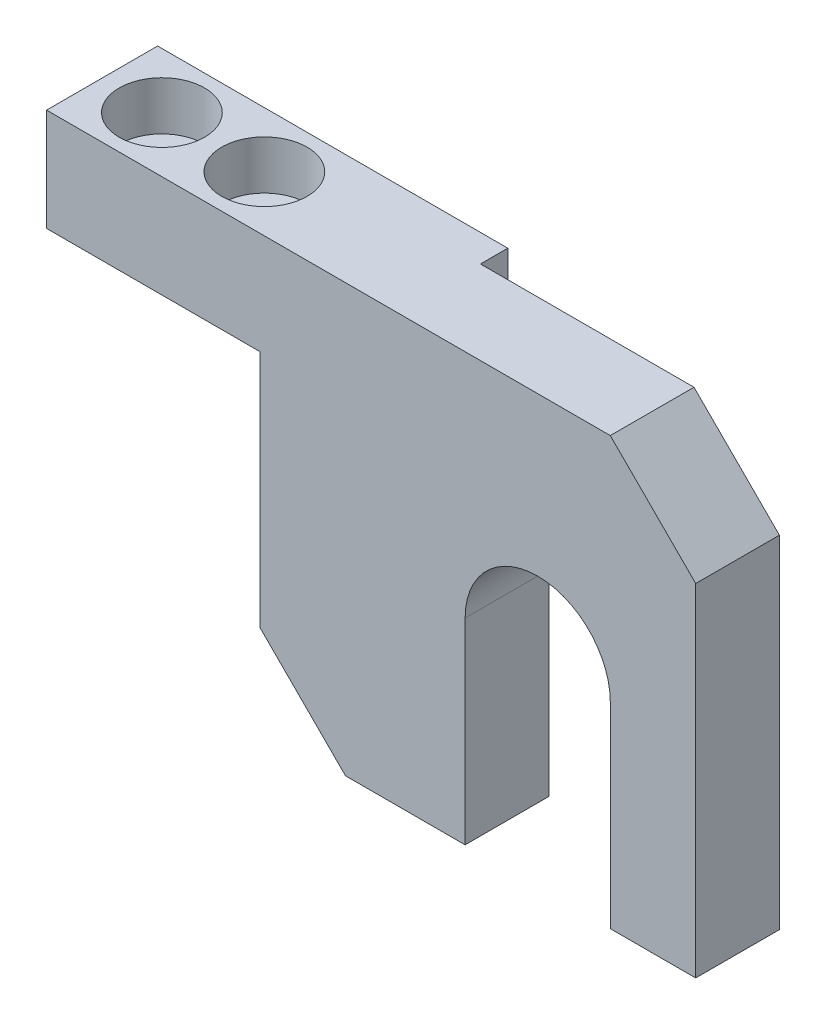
ISO-10303-21;
HEADER;
FILE_DESCRIPTION(('STEP AP214'),'2;1');
FILE_NAME('part.step','',(''),(''),'','','');
FILE_SCHEMA(('AUTOMOTIVE_DESIGN { 1 0 10303 214 1 1 1 1 }'));
ENDSEC;
DATA;
#1=APPLICATION_CONTEXT('core data for automotive mechanical design processes');
#2=APPLICATION_PROTOCOL_DEFINITION('international standard','automotive_design',2000,#1);
#3=PRODUCT_CONTEXT('',#1,'mechanical');
#4=PRODUCT('Part','Part','',(#3));
#5=PRODUCT_RELATED_PRODUCT_CATEGORY('part','',(#4));
#6=PRODUCT_DEFINITION_FORMATION('','',#4);
#7=PRODUCT_DEFINITION_CONTEXT('part definition',#1,'design');
#8=PRODUCT_DEFINITION('design','',#6,#7);
#9=PRODUCT_DEFINITION_SHAPE('','',#8);
#10=(LENGTH_UNIT() NAMED_UNIT(*) SI_UNIT(.MILLI.,.METRE.));
#11=(NAMED_UNIT(*) PLANE_ANGLE_UNIT() SI_UNIT($,.RADIAN.));
#12=(NAMED_UNIT(*) SI_UNIT($,.STERADIAN.) SOLID_ANGLE_UNIT());
#13=UNCERTAINTY_MEASURE_WITH_UNIT(LENGTH_MEASURE(1.E-05),#10,'distance_accuracy_value','');
#14=(GEOMETRIC_REPRESENTATION_CONTEXT(3) GLOBAL_UNCERTAINTY_ASSIGNED_CONTEXT((#13)) GLOBAL_UNIT_ASSIGNED_CONTEXT((#10,
#11,#12)) REPRESENTATION_CONTEXT('',''));
#15=CARTESIAN_POINT('',(0.,0.,0.));
#16=DIRECTION('',(0.,0.,1.));
#17=DIRECTION('',(1.,0.,0.));
#18=AXIS2_PLACEMENT_3D('',#15,#16,#17);
#19=CARTESIAN_POINT('',(57.5,-27.,13.));
#20=DIRECTION('',(0.,0.,-1.));
#21=DIRECTION('',(-1.,0.,0.));
#22=AXIS2_PLACEMENT_3D('',#19,#20,#21);
#23=CYLINDRICAL_SURFACE('',#22,8.5);
#24=DIRECTION('',(0.,0.,-1.));
#25=VECTOR('',#24,1.);
#26=CARTESIAN_POINT('',(49.,-27.,13.));
#27=LINE('',#26,#25);
#28=CARTESIAN_POINT('',(49.,-27.,13.));
#29=VERTEX_POINT('',#28);
#30=CARTESIAN_POINT('',(49.,-27.,3.2));
#31=VERTEX_POINT('',#30);
#32=EDGE_CURVE('E173',#29,#31,#27,.T.);
#33=ORIENTED_EDGE('',*,*,#32,.T.);
#34=CARTESIAN_POINT('',(57.5,-27.,3.2));
#35=DIRECTION('',(0.,0.,-1.));
#36=DIRECTION('',(-1.,0.,0.));
#37=AXIS2_PLACEMENT_3D('',#34,#35,#36);
#38=CIRCLE('',#37,8.5);
#39=CARTESIAN_POINT('',(66.,-27.,3.2));
#40=VERTEX_POINT('',#39);
#41=EDGE_CURVE('E146',#40,#31,#38,.F.);
#42=ORIENTED_EDGE('',*,*,#41,.F.);
#43=DIRECTION('',(0.,0.,-1.));
#44=VECTOR('',#43,1.);
#45=CARTESIAN_POINT('',(66.,-27.,13.));
#46=LINE('',#45,#44);
#47=CARTESIAN_POINT('',(66.,-27.,13.));
#48=VERTEX_POINT('',#47);
#49=EDGE_CURVE('E202',#48,#40,#46,.T.);
#50=ORIENTED_EDGE('',*,*,#49,.F.);
#51=CARTESIAN_POINT('',(57.5,-27.,13.));
#52=DIRECTION('',(0.,0.,1.));
#53=DIRECTION('',(1.,0.,0.));
#54=AXIS2_PLACEMENT_3D('',#51,#52,#53);
#55=CIRCLE('',#54,8.5);
#56=EDGE_CURVE('E150',#48,#29,#55,.T.);
#57=ORIENTED_EDGE('',*,*,#56,.T.);
#58=EDGE_LOOP('',(#33,#42,#50,#57));
#59=FACE_BOUND('',#58,.T.);
#60=ADVANCED_FACE('F16',(#59),#23,.F.);
#61=CARTESIAN_POINT('',(66.,0.,13.));
#62=DIRECTION('',(1.,0.,0.));
#63=DIRECTION('',(0.,0.,-1.));
#64=AXIS2_PLACEMENT_3D('',#61,#62,#63);
#65=PLANE('',#64);
#66=DIRECTION('',(0.,1.,0.));
#67=VECTOR('',#66,1.);
#68=CARTESIAN_POINT('',(66.,0.,3.2));
#69=LINE('',#68,#67);
#70=CARTESIAN_POINT('',(66.,-50.,3.2));
#71=VERTEX_POINT('',#70);
#72=EDGE_CURVE('E237',#71,#40,#69,.T.);
#73=ORIENTED_EDGE('',*,*,#72,.F.);
#74=DIRECTION('',(0.,0.,-1.));
#75=VECTOR('',#74,1.);
#76=CARTESIAN_POINT('',(66.,-50.,13.));
#77=LINE('',#76,#75);
#78=CARTESIAN_POINT('',(66.,-50.,13.));
#79=VERTEX_POINT('',#78);
#80=EDGE_CURVE('E199',#79,#71,#77,.T.);
#81=ORIENTED_EDGE('',*,*,#80,.F.);
#82=DIRECTION('',(0.,-1.,0.));
#83=VECTOR('',#82,1.);
#84=CARTESIAN_POINT('',(66.,0.,13.));
#85=LINE('',#84,#83);
#86=EDGE_CURVE('E153',#48,#79,#85,.T.);
#87=ORIENTED_EDGE('',*,*,#86,.F.);
#88=ORIENTED_EDGE('',*,*,#49,.T.);
#89=EDGE_LOOP('',(#73,#81,#87,#88));
#90=FACE_BOUND('',#89,.T.);
#91=ADVANCED_FACE('F285',(#90),#65,.F.);
#92=CARTESIAN_POINT('',(0.,-50.,13.));
#93=DIRECTION('',(0.,1.,0.));
#94=DIRECTION('',(0.,0.,1.));
#95=AXIS2_PLACEMENT_3D('',#92,#93,#94);
#96=PLANE('',#95);
#97=DIRECTION('',(-1.,0.,0.));
#98=VECTOR('',#97,1.);
#99=CARTESIAN_POINT('',(0.,-50.,3.2));
#100=LINE('',#99,#98);
#101=CARTESIAN_POINT('',(76.,-50.,3.2));
#102=VERTEX_POINT('',#101);
#103=EDGE_CURVE('E235',#102,#71,#100,.T.);
#104=ORIENTED_EDGE('',*,*,#103,.F.);
#105=DIRECTION('',(0.,0.,-1.));
#106=VECTOR('',#105,1.);
#107=CARTESIAN_POINT('',(76.,-50.,13.));
#108=LINE('',#107,#106);
#109=CARTESIAN_POINT('',(76.,-50.,13.));
#110=VERTEX_POINT('',#109);
#111=EDGE_CURVE('E196',#110,#102,#108,.T.);
#112=ORIENTED_EDGE('',*,*,#111,.F.);
#113=DIRECTION('',(1.,0.,0.));
#114=VECTOR('',#113,1.);
#115=CARTESIAN_POINT('',(0.,-50.,13.));
#116=LINE('',#115,#114);
#117=EDGE_CURVE('E155',#79,#110,#116,.T.);
#118=ORIENTED_EDGE('',*,*,#117,.F.);
#119=ORIENTED_EDGE('',*,*,#80,.T.);
#120=EDGE_LOOP('',(#104,#112,#118,#119));
#121=FACE_BOUND('',#120,.T.);
#122=ADVANCED_FACE('F282',(#121),#96,.F.);
#123=CARTESIAN_POINT('',(76.,0.,13.));
#124=DIRECTION('',(1.,0.,0.));
#125=DIRECTION('',(0.,0.,-1.));
#126=AXIS2_PLACEMENT_3D('',#123,#124,#125);
#127=PLANE('',#126);
#128=ORIENTED_EDGE('',*,*,#111,.T.);
#129=DIRECTION('',(0.,-1.,0.));
#130=VECTOR('',#129,1.);
#131=CARTESIAN_POINT('',(76.,0.,3.2));
#132=LINE('',#131,#130);
#133=CARTESIAN_POINT('',(76.,-10.,3.2));
#134=VERTEX_POINT('',#133);
#135=EDGE_CURVE('E233',#134,#102,#132,.T.);
#136=ORIENTED_EDGE('',*,*,#135,.F.);
#137=DIRECTION('',(0.,0.,1.));
#138=VECTOR('',#137,1.);
#139=CARTESIAN_POINT('',(76.,-10.,13.));
#140=LINE('',#139,#138);
#141=CARTESIAN_POINT('',(76.,-10.,13.));
#142=VERTEX_POINT('',#141);
#143=EDGE_CURVE('E11',#134,#142,#140,.T.);
#144=ORIENTED_EDGE('',*,*,#143,.T.);
#145=DIRECTION('',(0.,-1.,0.));
#146=VECTOR('',#145,1.);
#147=CARTESIAN_POINT('',(76.,0.,13.));
#148=LINE('',#147,#146);
#149=EDGE_CURVE('E158',#142,#110,#148,.T.);
#150=ORIENTED_EDGE('',*,*,#149,.T.);
#151=EDGE_LOOP('',(#128,#136,#144,#150));
#152=FACE_BOUND('',#151,.T.);
#153=ADVANCED_FACE('F278',(#152),#127,.T.);
#154=CARTESIAN_POINT('',(49.,0.,13.));
#155=DIRECTION('',(1.,0.,0.));
#156=DIRECTION('',(0.,0.,-1.));
#157=AXIS2_PLACEMENT_3D('',#154,#155,#156);
#158=PLANE('',#157);
#159=DIRECTION('',(0.,0.,-1.));
#160=VECTOR('',#159,1.);
#161=CARTESIAN_POINT('',(49.,-50.,13.));
#162=LINE('',#161,#160);
#163=CARTESIAN_POINT('',(49.,-50.,13.));
#164=VERTEX_POINT('',#163);
#165=CARTESIAN_POINT('',(49.,-50.,3.2));
#166=VERTEX_POINT('',#165);
#167=EDGE_CURVE('E186',#164,#166,#162,.T.);
#168=ORIENTED_EDGE('',*,*,#167,.T.);
#169=DIRECTION('',(0.,-1.,0.));
#170=VECTOR('',#169,1.);
#171=CARTESIAN_POINT('',(49.,0.,3.2));
#172=LINE('',#171,#170);
#173=EDGE_CURVE('E132',#31,#166,#172,.T.);
#174=ORIENTED_EDGE('',*,*,#173,.F.);
#175=ORIENTED_EDGE('',*,*,#32,.F.);
#176=DIRECTION('',(0.,-1.,0.));
#177=VECTOR('',#176,1.);
#178=CARTESIAN_POINT('',(49.,0.,13.));
#179=LINE('',#178,#177);
#180=EDGE_CURVE('E170',#29,#164,#179,.T.);
#181=ORIENTED_EDGE('',*,*,#180,.T.);
#182=EDGE_LOOP('',(#168,#174,#175,#181));
#183=FACE_BOUND('',#182,.T.);
#184=ADVANCED_FACE('F243',(#183),#158,.T.);
#185=CARTESIAN_POINT('',(66.,0.,13.));
#186=DIRECTION('',(-0.707106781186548,-0.707106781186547,0.));
#187=DIRECTION('',(0.707106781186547,-0.707106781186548,0.));
#188=AXIS2_PLACEMENT_3D('',#185,#186,#187);
#189=PLANE('',#188);
#190=ORIENTED_EDGE('',*,*,#143,.F.);
#191=DIRECTION('',(0.707106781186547,-0.707106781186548,0.));
#192=VECTOR('',#191,1.);
#193=CARTESIAN_POINT('',(33.,33.,3.2));
#194=LINE('',#193,#192);
#195=CARTESIAN_POINT('',(66.,0.,3.2));
#196=VERTEX_POINT('',#195);
#197=EDGE_CURVE('E231',#196,#134,#194,.T.);
#198=ORIENTED_EDGE('',*,*,#197,.F.);
#199=DIRECTION('',(0.,0.,-1.));
#200=VECTOR('',#199,1.);
#201=CARTESIAN_POINT('',(66.,0.,13.));
#202=LINE('',#201,#200);
#203=CARTESIAN_POINT('',(66.,0.,13.));
#204=VERTEX_POINT('',#203);
#205=EDGE_CURVE('E25',#204,#196,#202,.T.);
#206=ORIENTED_EDGE('',*,*,#205,.F.);
#207=DIRECTION('',(0.707106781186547,-0.707106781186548,0.));
#208=VECTOR('',#207,1.);
#209=CARTESIAN_POINT('',(33.,33.,13.));
#210=LINE('',#209,#208);
#211=EDGE_CURVE('E41',#142,#204,#210,.F.);
#212=ORIENTED_EDGE('',*,*,#211,.F.);
#213=EDGE_LOOP('',(#190,#198,#206,#212));
#214=FACE_BOUND('',#213,.T.);
#215=ADVANCED_FACE('F18',(#214),#189,.F.);
#216=CARTESIAN_POINT('',(0.,0.,13.));
#217=DIRECTION('',(0.,1.,0.));
#218=DIRECTION('',(0.,0.,1.));
#219=AXIS2_PLACEMENT_3D('',#216,#217,#218);
#220=PLANE('',#219);
#221=CARTESIAN_POINT('',(19.,0.,6.5));
#222=DIRECTION('',(0.,1.,0.));
#223=DIRECTION('',(0.,0.,1.));
#224=AXIS2_PLACEMENT_3D('',#221,#222,#223);
#225=CIRCLE('',#224,5.);
#226=CARTESIAN_POINT('',(19.,0.,11.5));
#227=VERTEX_POINT('',#226);
#228=EDGE_CURVE('E331',#227,#227,#225,.T.);
#229=ORIENTED_EDGE('',*,*,#228,.F.);
#230=EDGE_LOOP('',(#229));
#231=FACE_BOUND('',#230,.T.);
#232=CARTESIAN_POINT('',(7.,0.,6.5));
#233=DIRECTION('',(0.,1.,0.));
#234=DIRECTION('',(0.,0.,1.));
#235=AXIS2_PLACEMENT_3D('',#232,#233,#234);
#236=CIRCLE('',#235,5.);
#237=CARTESIAN_POINT('',(7.,0.,11.5));
#238=VERTEX_POINT('',#237);
#239=EDGE_CURVE('E226',#238,#238,#236,.T.);
#240=ORIENTED_EDGE('',*,*,#239,.F.);
#241=EDGE_LOOP('',(#240));
#242=FACE_BOUND('',#241,.T.);
#243=DIRECTION('',(0.,0.,-1.));
#244=VECTOR('',#243,1.);
#245=CARTESIAN_POINT('',(41.,0.,3.2));
#246=LINE('',#245,#244);
#247=CARTESIAN_POINT('',(41.,0.,3.2));
#248=VERTEX_POINT('',#247);
#249=CARTESIAN_POINT('',(41.,0.,0.));
#250=VERTEX_POINT('',#249);
#251=EDGE_CURVE('E126',#248,#250,#246,.T.);
#252=ORIENTED_EDGE('',*,*,#251,.T.);
#253=DIRECTION('',(1.,0.,0.));
#254=VECTOR('',#253,1.);
#255=CARTESIAN_POINT('',(0.,0.,0.));
#256=LINE('',#255,#254);
#257=CARTESIAN_POINT('',(0.,0.,0.));
#258=VERTEX_POINT('',#257);
#259=EDGE_CURVE('E144',#258,#250,#256,.T.);
#260=ORIENTED_EDGE('',*,*,#259,.F.);
#261=DIRECTION('',(0.,0.,-1.));
#262=VECTOR('',#261,1.);
#263=CARTESIAN_POINT('',(0.,0.,13.));
#264=LINE('',#263,#262);
#265=CARTESIAN_POINT('',(0.,0.,13.));
#266=VERTEX_POINT('',#265);
#267=EDGE_CURVE('E194',#266,#258,#264,.T.);
#268=ORIENTED_EDGE('',*,*,#267,.F.);
#269=DIRECTION('',(1.,0.,0.));
#270=VECTOR('',#269,1.);
#271=CARTESIAN_POINT('',(0.,0.,13.));
#272=LINE('',#271,#270);
#273=EDGE_CURVE('E161',#266,#204,#272,.T.);
#274=ORIENTED_EDGE('',*,*,#273,.T.);
#275=ORIENTED_EDGE('',*,*,#205,.T.);
#276=DIRECTION('',(1.,0.,0.));
#277=VECTOR('',#276,1.);
#278=CARTESIAN_POINT('',(0.,0.,3.2));
#279=LINE('',#278,#277);
#280=EDGE_CURVE('E33',#248,#196,#279,.T.);
#281=ORIENTED_EDGE('',*,*,#280,.F.);
#282=EDGE_LOOP('',(#252,#260,#268,#274,#275,#281));
#283=FACE_BOUND('',#282,.T.);
#284=ADVANCED_FACE('F270',(#231,#242,#283),#220,.T.);
#285=CARTESIAN_POINT('',(0.,0.,13.));
#286=DIRECTION('',(1.,0.,0.));
#287=DIRECTION('',(0.,1.,0.));
#288=AXIS2_PLACEMENT_3D('',#285,#286,#287);
#289=PLANE('',#288);
#290=DIRECTION('',(0.,-1.,0.));
#291=VECTOR('',#290,1.);
#292=CARTESIAN_POINT('',(0.,0.,0.));
#293=LINE('',#292,#291);
#294=CARTESIAN_POINT('',(0.,-12.,0.));
#295=VERTEX_POINT('',#294);
#296=EDGE_CURVE('E178',#258,#295,#293,.T.);
#297=ORIENTED_EDGE('',*,*,#296,.T.);
#298=DIRECTION('',(0.,0.,-1.));
#299=VECTOR('',#298,1.);
#300=CARTESIAN_POINT('',(0.,-12.,13.));
#301=LINE('',#300,#299);
#302=CARTESIAN_POINT('',(0.,-12.,13.));
#303=VERTEX_POINT('',#302);
#304=EDGE_CURVE('E191',#303,#295,#301,.T.);
#305=ORIENTED_EDGE('',*,*,#304,.F.);
#306=DIRECTION('',(0.,-1.,0.));
#307=VECTOR('',#306,1.);
#308=CARTESIAN_POINT('',(0.,0.,13.));
#309=LINE('',#308,#307);
#310=EDGE_CURVE('E163',#266,#303,#309,.T.);
#311=ORIENTED_EDGE('',*,*,#310,.F.);
#312=ORIENTED_EDGE('',*,*,#267,.T.);
#313=EDGE_LOOP('',(#297,#305,#311,#312));
#314=FACE_BOUND('',#313,.T.);
#315=ADVANCED_FACE('F319',(#314),#289,.F.);
#316=CARTESIAN_POINT('',(0.,-12.,13.));
#317=DIRECTION('',(0.,1.,0.));
#318=DIRECTION('',(0.,0.,1.));
#319=AXIS2_PLACEMENT_3D('',#316,#317,#318);
#320=PLANE('',#319);
#321=CARTESIAN_POINT('',(19.,-12.,6.5));
#322=DIRECTION('',(0.,1.,0.));
#323=DIRECTION('',(0.,0.,1.));
#324=AXIS2_PLACEMENT_3D('',#321,#322,#323);
#325=CIRCLE('',#324,2.75);
#326=CARTESIAN_POINT('',(19.,-12.,9.25));
#327=VERTEX_POINT('',#326);
#328=EDGE_CURVE('E20',#327,#327,#325,.T.);
#329=ORIENTED_EDGE('',*,*,#328,.T.);
#330=EDGE_LOOP('',(#329));
#331=FACE_BOUND('',#330,.T.);
#332=CARTESIAN_POINT('',(7.,-12.,6.5));
#333=DIRECTION('',(0.,1.,0.));
#334=DIRECTION('',(0.,0.,1.));
#335=AXIS2_PLACEMENT_3D('',#332,#333,#334);
#336=CIRCLE('',#335,2.75);
#337=CARTESIAN_POINT('',(7.,-12.,9.25));
#338=VERTEX_POINT('',#337);
#339=EDGE_CURVE('E215',#338,#338,#336,.T.);
#340=ORIENTED_EDGE('',*,*,#339,.T.);
#341=EDGE_LOOP('',(#340));
#342=FACE_BOUND('',#341,.T.);
#343=DIRECTION('',(1.,0.,0.));
#344=VECTOR('',#343,1.);
#345=CARTESIAN_POINT('',(0.,-12.,0.));
#346=LINE('',#345,#344);
#347=CARTESIAN_POINT('',(25.,-12.,0.));
#348=VERTEX_POINT('',#347);
#349=EDGE_CURVE('E180',#295,#348,#346,.T.);
#350=ORIENTED_EDGE('',*,*,#349,.T.);
#351=DIRECTION('',(0.,0.,-1.));
#352=VECTOR('',#351,1.);
#353=CARTESIAN_POINT('',(25.,-12.,13.));
#354=LINE('',#353,#352);
#355=CARTESIAN_POINT('',(25.,-12.,13.));
#356=VERTEX_POINT('',#355);
#357=EDGE_CURVE('E188',#356,#348,#354,.T.);
#358=ORIENTED_EDGE('',*,*,#357,.F.);
#359=DIRECTION('',(1.,0.,0.));
#360=VECTOR('',#359,1.);
#361=CARTESIAN_POINT('',(0.,-12.,13.));
#362=LINE('',#361,#360);
#363=EDGE_CURVE('E165',#303,#356,#362,.T.);
#364=ORIENTED_EDGE('',*,*,#363,.F.);
#365=ORIENTED_EDGE('',*,*,#304,.T.);
#366=EDGE_LOOP('',(#350,#358,#364,#365));
#367=FACE_BOUND('',#366,.T.);
#368=ADVANCED_FACE('F264',(#331,#342,#367),#320,.F.);
#369=CARTESIAN_POINT('',(25.,0.,13.));
#370=DIRECTION('',(1.,0.,0.));
#371=DIRECTION('',(0.,1.,0.));
#372=AXIS2_PLACEMENT_3D('',#369,#370,#371);
#373=PLANE('',#372);
#374=DIRECTION('',(0.,-1.,0.));
#375=VECTOR('',#374,1.);
#376=CARTESIAN_POINT('',(25.,0.,0.));
#377=LINE('',#376,#375);
#378=CARTESIAN_POINT('',(25.,-40.,0.));
#379=VERTEX_POINT('',#378);
#380=EDGE_CURVE('E175',#348,#379,#377,.T.);
#381=ORIENTED_EDGE('',*,*,#380,.T.);
#382=DIRECTION('',(0.,0.,1.));
#383=VECTOR('',#382,1.);
#384=CARTESIAN_POINT('',(25.,-40.,13.));
#385=LINE('',#384,#383);
#386=CARTESIAN_POINT('',(25.,-40.,13.));
#387=VERTEX_POINT('',#386);
#388=EDGE_CURVE('E209',#379,#387,#385,.T.);
#389=ORIENTED_EDGE('',*,*,#388,.T.);
#390=DIRECTION('',(0.,-1.,0.));
#391=VECTOR('',#390,1.);
#392=CARTESIAN_POINT('',(25.,0.,13.));
#393=LINE('',#392,#391);
#394=EDGE_CURVE('E167',#356,#387,#393,.T.);
#395=ORIENTED_EDGE('',*,*,#394,.F.);
#396=ORIENTED_EDGE('',*,*,#357,.T.);
#397=EDGE_LOOP('',(#381,#389,#395,#396));
#398=FACE_BOUND('',#397,.T.);
#399=ADVANCED_FACE('F259',(#398),#373,.F.);
#400=DIRECTION('',(1.,0.,0.));
#401=VECTOR('',#400,1.);
#402=CARTESIAN_POINT('',(0.,-50.,0.));
#403=LINE('',#402,#401);
#404=CARTESIAN_POINT('',(35.,-50.,0.));
#405=VERTEX_POINT('',#404);
#406=CARTESIAN_POINT('',(41.,-50.,0.));
#407=VERTEX_POINT('',#406);
#408=EDGE_CURVE('E142',#405,#407,#403,.T.);
#409=ORIENTED_EDGE('',*,*,#408,.T.);
#410=DIRECTION('',(0.,0.,-1.));
#411=VECTOR('',#410,1.);
#412=CARTESIAN_POINT('',(41.,-50.,3.2));
#413=LINE('',#412,#411);
#414=CARTESIAN_POINT('',(41.,-50.,3.2));
#415=VERTEX_POINT('',#414);
#416=EDGE_CURVE('E123',#415,#407,#413,.T.);
#417=ORIENTED_EDGE('',*,*,#416,.F.);
#418=DIRECTION('',(-1.,0.,0.));
#419=VECTOR('',#418,1.);
#420=CARTESIAN_POINT('',(0.,-50.,3.2));
#421=LINE('',#420,#419);
#422=EDGE_CURVE('E127',#166,#415,#421,.T.);
#423=ORIENTED_EDGE('',*,*,#422,.F.);
#424=ORIENTED_EDGE('',*,*,#167,.F.);
#425=CARTESIAN_POINT('',(35.,-50.,13.));
#426=VERTEX_POINT('',#425);
#427=EDGE_CURVE('E159',#426,#164,#116,.T.);
#428=ORIENTED_EDGE('',*,*,#427,.F.);
#429=DIRECTION('',(0.,0.,-1.));
#430=VECTOR('',#429,1.);
#431=CARTESIAN_POINT('',(35.,-50.,13.));
#432=LINE('',#431,#430);
#433=EDGE_CURVE('E205',#426,#405,#432,.T.);
#434=ORIENTED_EDGE('',*,*,#433,.T.);
#435=EDGE_LOOP('',(#409,#417,#423,#424,#428,#434));
#436=FACE_BOUND('',#435,.T.);
#437=ADVANCED_FACE('F139',(#436),#96,.F.);
#438=CARTESIAN_POINT('',(0.,0.,13.));
#439=DIRECTION('',(0.,0.,1.));
#440=DIRECTION('',(1.,0.,0.));
#441=AXIS2_PLACEMENT_3D('',#438,#439,#440);
#442=PLANE('',#441);
#443=ORIENTED_EDGE('',*,*,#394,.T.);
#444=DIRECTION('',(-0.707106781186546,0.707106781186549,0.));
#445=VECTOR('',#444,1.);
#446=CARTESIAN_POINT('',(-7.49999999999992,-7.49999999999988,13.));
#447=LINE('',#446,#445);
#448=EDGE_CURVE('E212',#387,#426,#447,.F.);
#449=ORIENTED_EDGE('',*,*,#448,.T.);
#450=ORIENTED_EDGE('',*,*,#427,.T.);
#451=ORIENTED_EDGE('',*,*,#180,.F.);
#452=ORIENTED_EDGE('',*,*,#56,.F.);
#453=ORIENTED_EDGE('',*,*,#86,.T.);
#454=ORIENTED_EDGE('',*,*,#117,.T.);
#455=ORIENTED_EDGE('',*,*,#149,.F.);
#456=ORIENTED_EDGE('',*,*,#211,.T.);
#457=ORIENTED_EDGE('',*,*,#273,.F.);
#458=ORIENTED_EDGE('',*,*,#310,.T.);
#459=ORIENTED_EDGE('',*,*,#363,.T.);
#460=EDGE_LOOP('',(#443,#449,#450,#451,#452,#453,#454,#455,#456,#457,#458,#459));
#461=FACE_BOUND('',#460,.T.);
#462=ADVANCED_FACE('F247',(#461),#442,.T.);
#463=CARTESIAN_POINT('',(0.,0.,0.));
#464=DIRECTION('',(0.,0.,1.));
#465=DIRECTION('',(1.,0.,0.));
#466=AXIS2_PLACEMENT_3D('',#463,#464,#465);
#467=PLANE('',#466);
#468=ORIENTED_EDGE('',*,*,#259,.T.);
#469=DIRECTION('',(0.,1.,0.));
#470=VECTOR('',#469,1.);
#471=CARTESIAN_POINT('',(41.,0.,0.));
#472=LINE('',#471,#470);
#473=EDGE_CURVE('E136',#407,#250,#472,.T.);
#474=ORIENTED_EDGE('',*,*,#473,.F.);
#475=ORIENTED_EDGE('',*,*,#408,.F.);
#476=DIRECTION('',(0.707106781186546,-0.707106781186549,0.));
#477=VECTOR('',#476,1.);
#478=CARTESIAN_POINT('',(35.,-50.,0.));
#479=LINE('',#478,#477);
#480=EDGE_CURVE('E207',#405,#379,#479,.F.);
#481=ORIENTED_EDGE('',*,*,#480,.T.);
#482=ORIENTED_EDGE('',*,*,#380,.F.);
#483=ORIENTED_EDGE('',*,*,#349,.F.);
#484=ORIENTED_EDGE('',*,*,#296,.F.);
#485=EDGE_LOOP('',(#468,#474,#475,#481,#482,#483,#484));
#486=FACE_BOUND('',#485,.T.);
#487=ADVANCED_FACE('F256',(#486),#467,.F.);
#488=CARTESIAN_POINT('',(35.,-50.,13.));
#489=DIRECTION('',(0.707106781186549,0.707106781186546,0.));
#490=DIRECTION('',(-0.707106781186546,0.707106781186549,0.));
#491=AXIS2_PLACEMENT_3D('',#488,#489,#490);
#492=PLANE('',#491);
#493=ORIENTED_EDGE('',*,*,#448,.F.);
#494=ORIENTED_EDGE('',*,*,#388,.F.);
#495=ORIENTED_EDGE('',*,*,#480,.F.);
#496=ORIENTED_EDGE('',*,*,#433,.F.);
#497=EDGE_LOOP('',(#493,#494,#495,#496));
#498=FACE_BOUND('',#497,.T.);
#499=ADVANCED_FACE('F252',(#498),#492,.F.);
#500=CARTESIAN_POINT('',(41.,0.,3.2));
#501=DIRECTION('',(-1.,0.,0.));
#502=DIRECTION('',(0.,0.,1.));
#503=AXIS2_PLACEMENT_3D('',#500,#501,#502);
#504=PLANE('',#503);
#505=ORIENTED_EDGE('',*,*,#473,.T.);
#506=ORIENTED_EDGE('',*,*,#251,.F.);
#507=DIRECTION('',(0.,1.,0.));
#508=VECTOR('',#507,1.);
#509=CARTESIAN_POINT('',(41.,0.,3.2));
#510=LINE('',#509,#508);
#511=EDGE_CURVE('E119',#415,#248,#510,.T.);
#512=ORIENTED_EDGE('',*,*,#511,.F.);
#513=ORIENTED_EDGE('',*,*,#416,.T.);
#514=EDGE_LOOP('',(#505,#506,#512,#513));
#515=FACE_BOUND('',#514,.T.);
#516=ADVANCED_FACE('F121',(#515),#504,.F.);
#517=CARTESIAN_POINT('',(0.,0.,3.2));
#518=DIRECTION('',(0.,0.,-1.));
#519=DIRECTION('',(-1.,0.,0.));
#520=AXIS2_PLACEMENT_3D('',#517,#518,#519);
#521=PLANE('',#520);
#522=ORIENTED_EDGE('',*,*,#422,.T.);
#523=ORIENTED_EDGE('',*,*,#511,.T.);
#524=ORIENTED_EDGE('',*,*,#280,.T.);
#525=ORIENTED_EDGE('',*,*,#197,.T.);
#526=ORIENTED_EDGE('',*,*,#135,.T.);
#527=ORIENTED_EDGE('',*,*,#103,.T.);
#528=ORIENTED_EDGE('',*,*,#72,.T.);
#529=ORIENTED_EDGE('',*,*,#41,.T.);
#530=ORIENTED_EDGE('',*,*,#173,.T.);
#531=EDGE_LOOP('',(#522,#523,#524,#525,#526,#527,#528,#529,#530));
#532=FACE_BOUND('',#531,.T.);
#533=ADVANCED_FACE('F130',(#532),#521,.T.);
#534=CARTESIAN_POINT('',(7.,0.,6.5));
#535=DIRECTION('',(0.,1.,0.));
#536=DIRECTION('',(0.,0.,1.));
#537=AXIS2_PLACEMENT_3D('',#534,#535,#536);
#538=CYLINDRICAL_SURFACE('',#537,2.75);
#539=CARTESIAN_POINT('',(7.,-5.7,6.5));
#540=DIRECTION('',(0.,1.,0.));
#541=DIRECTION('',(0.,0.,1.));
#542=AXIS2_PLACEMENT_3D('',#539,#540,#541);
#543=CIRCLE('',#542,2.75);
#544=CARTESIAN_POINT('',(7.,-5.7,9.25));
#545=VERTEX_POINT('',#544);
#546=EDGE_CURVE('E217',#545,#545,#543,.T.);
#547=ORIENTED_EDGE('',*,*,#546,.T.);
#548=EDGE_LOOP('',(#547));
#549=FACE_BOUND('',#548,.T.);
#550=ORIENTED_EDGE('',*,*,#339,.F.);
#551=EDGE_LOOP('',(#550));
#552=FACE_BOUND('',#551,.T.);
#553=ADVANCED_FACE('F368',(#549,#552),#538,.F.);
#554=CARTESIAN_POINT('',(9.75,-5.7,6.5));
#555=DIRECTION('',(0.,-1.,0.));
#556=DIRECTION('',(0.,0.,-1.));
#557=AXIS2_PLACEMENT_3D('',#554,#555,#556);
#558=PLANE('',#557);
#559=ORIENTED_EDGE('',*,*,#546,.F.);
#560=EDGE_LOOP('',(#559));
#561=FACE_BOUND('',#560,.T.);
#562=CARTESIAN_POINT('',(7.,-5.7,6.5));
#563=DIRECTION('',(0.,1.,0.));
#564=DIRECTION('',(0.,0.,1.));
#565=AXIS2_PLACEMENT_3D('',#562,#563,#564);
#566=CIRCLE('',#565,5.);
#567=CARTESIAN_POINT('',(7.,-5.7,11.5));
#568=VERTEX_POINT('',#567);
#569=EDGE_CURVE('E221',#568,#568,#566,.T.);
#570=ORIENTED_EDGE('',*,*,#569,.T.);
#571=EDGE_LOOP('',(#570));
#572=FACE_BOUND('',#571,.T.);
#573=ADVANCED_FACE('F364',(#561,#572),#558,.F.);
#574=CARTESIAN_POINT('',(7.,0.,6.5));
#575=DIRECTION('',(0.,1.,0.));
#576=DIRECTION('',(0.,0.,1.));
#577=AXIS2_PLACEMENT_3D('',#574,#575,#576);
#578=CYLINDRICAL_SURFACE('',#577,5.);
#579=ORIENTED_EDGE('',*,*,#569,.F.);
#580=EDGE_LOOP('',(#579));
#581=FACE_BOUND('',#580,.T.);
#582=ORIENTED_EDGE('',*,*,#239,.T.);
#583=EDGE_LOOP('',(#582));
#584=FACE_BOUND('',#583,.T.);
#585=ADVANCED_FACE('F360',(#581,#584),#578,.F.);
#586=CARTESIAN_POINT('',(19.,0.,6.5));
#587=DIRECTION('',(0.,1.,0.));
#588=DIRECTION('',(0.,0.,1.));
#589=AXIS2_PLACEMENT_3D('',#586,#587,#588);
#590=CYLINDRICAL_SURFACE('',#589,2.75);
#591=CARTESIAN_POINT('',(19.,-5.7,6.5));
#592=DIRECTION('',(0.,1.,0.));
#593=DIRECTION('',(0.,0.,1.));
#594=AXIS2_PLACEMENT_3D('',#591,#592,#593);
#595=CIRCLE('',#594,2.75);
#596=CARTESIAN_POINT('',(19.,-5.7,9.25));
#597=VERTEX_POINT('',#596);
#598=EDGE_CURVE('E336',#597,#597,#595,.T.);
#599=ORIENTED_EDGE('',*,*,#598,.T.);
#600=EDGE_LOOP('',(#599));
#601=FACE_BOUND('',#600,.T.);
#602=ORIENTED_EDGE('',*,*,#328,.F.);
#603=EDGE_LOOP('',(#602));
#604=FACE_BOUND('',#603,.T.);
#605=ADVANCED_FACE('F353',(#601,#604),#590,.F.);
#606=CARTESIAN_POINT('',(21.75,-5.7,6.5));
#607=DIRECTION('',(0.,-1.,0.));
#608=DIRECTION('',(0.,0.,-1.));
#609=AXIS2_PLACEMENT_3D('',#606,#607,#608);
#610=PLANE('',#609);
#611=ORIENTED_EDGE('',*,*,#598,.F.);
#612=EDGE_LOOP('',(#611));
#613=FACE_BOUND('',#612,.T.);
#614=CARTESIAN_POINT('',(19.,-5.7,6.5));
#615=DIRECTION('',(0.,1.,0.));
#616=DIRECTION('',(0.,0.,1.));
#617=AXIS2_PLACEMENT_3D('',#614,#615,#616);
#618=CIRCLE('',#617,5.);
#619=CARTESIAN_POINT('',(19.,-5.7,11.5));
#620=VERTEX_POINT('',#619);
#621=EDGE_CURVE('E340',#620,#620,#618,.T.);
#622=ORIENTED_EDGE('',*,*,#621,.T.);
#623=EDGE_LOOP('',(#622));
#624=FACE_BOUND('',#623,.T.);
#625=ADVANCED_FACE('F346',(#613,#624),#610,.F.);
#626=CARTESIAN_POINT('',(19.,0.,6.5));
#627=DIRECTION('',(0.,1.,0.));
#628=DIRECTION('',(0.,0.,1.));
#629=AXIS2_PLACEMENT_3D('',#626,#627,#628);
#630=CYLINDRICAL_SURFACE('',#629,5.);
#631=ORIENTED_EDGE('',*,*,#621,.F.);
#632=EDGE_LOOP('',(#631));
#633=FACE_BOUND('',#632,.T.);
#634=ORIENTED_EDGE('',*,*,#228,.T.);
#635=EDGE_LOOP('',(#634));
#636=FACE_BOUND('',#635,.T.);
#637=ADVANCED_FACE('F344',(#633,#636),#630,.F.);
#638=CLOSED_SHELL('',(#60,#91,#122,#153,#184,#215,#284,#315,#368,#399,#437,#462,#487,#499,#516,
#533,#553,#573,#585,#605,#625,#637));
#639=MANIFOLD_SOLID_BREP('B1',#638);
#640=ADVANCED_BREP_SHAPE_REPRESENTATION('',(#18,#639),#14);
#641=SHAPE_DEFINITION_REPRESENTATION(#9,#640);
ENDSEC;
END-ISO-10303-21;
